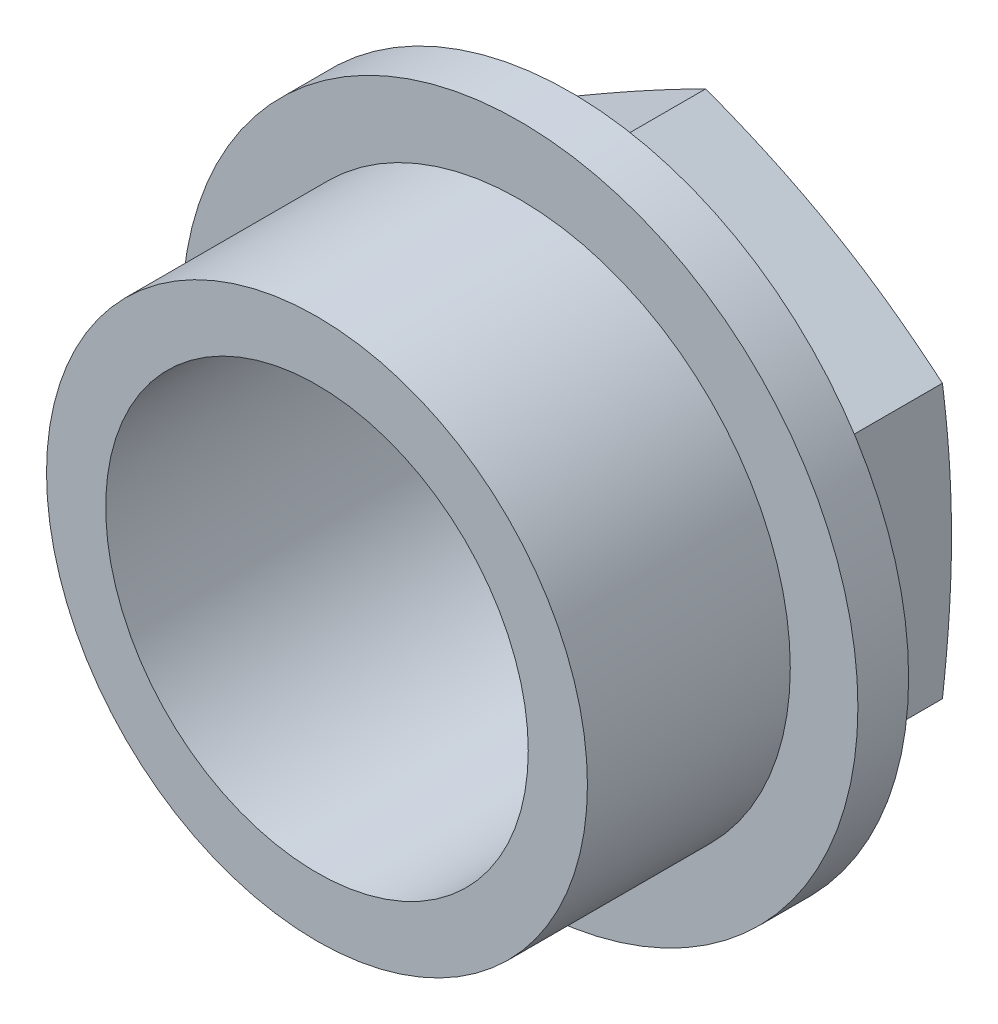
ISO-10303-21;
HEADER;
FILE_DESCRIPTION(('STEP AP214'),'2;1');
FILE_NAME('part.step','',(''),(''),'','','');
FILE_SCHEMA(('AUTOMOTIVE_DESIGN { 1 0 10303 214 1 1 1 1 }'));
ENDSEC;
DATA;
#1=APPLICATION_CONTEXT('core data for automotive mechanical design processes');
#2=APPLICATION_PROTOCOL_DEFINITION('international standard','automotive_design',2000,#1);
#3=PRODUCT_CONTEXT('',#1,'mechanical');
#4=PRODUCT('Part','Part','',(#3));
#5=PRODUCT_RELATED_PRODUCT_CATEGORY('part','',(#4));
#6=PRODUCT_DEFINITION_FORMATION('','',#4);
#7=PRODUCT_DEFINITION_CONTEXT('part definition',#1,'design');
#8=PRODUCT_DEFINITION('design','',#6,#7);
#9=PRODUCT_DEFINITION_SHAPE('','',#8);
#10=(LENGTH_UNIT() NAMED_UNIT(*) SI_UNIT(.MILLI.,.METRE.));
#11=(NAMED_UNIT(*) PLANE_ANGLE_UNIT() SI_UNIT($,.RADIAN.));
#12=(NAMED_UNIT(*) SI_UNIT($,.STERADIAN.) SOLID_ANGLE_UNIT());
#13=UNCERTAINTY_MEASURE_WITH_UNIT(LENGTH_MEASURE(1.E-05),#10,'distance_accuracy_value','');
#14=(GEOMETRIC_REPRESENTATION_CONTEXT(3) GLOBAL_UNCERTAINTY_ASSIGNED_CONTEXT((#13)) GLOBAL_UNIT_ASSIGNED_CONTEXT((#10,
#11,#12)) REPRESENTATION_CONTEXT('',''));
#15=CARTESIAN_POINT('',(0.,0.,0.));
#16=DIRECTION('',(0.,0.,1.));
#17=DIRECTION('',(1.,0.,0.));
#18=AXIS2_PLACEMENT_3D('',#15,#16,#17);
#19=CARTESIAN_POINT('',(-7.,4.04145188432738,-6.));
#20=DIRECTION('',(0.5,-0.866025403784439,0.));
#21=DIRECTION('',(0.866025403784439,0.5,0.));
#22=AXIS2_PLACEMENT_3D('',#19,#20,#21);
#23=PLANE('',#22);
#24=CARTESIAN_POINT('',(-7.0002,4.04133641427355,-3.99997139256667));
#25=CARTESIAN_POINT('',(-6.70935090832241,4.20925821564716,-4.04159057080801));
#26=CARTESIAN_POINT('',(-6.41804989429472,4.37744093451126,-4.07936064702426));
#27=CARTESIAN_POINT('',(-5.83456809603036,4.71431430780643,-4.14570329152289));
#28=CARTESIAN_POINT('',(-5.54238704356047,4.88300511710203,-4.17427269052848));
#29=CARTESIAN_POINT('',(-4.95866165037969,5.22001912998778,-4.22058144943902));
#30=CARTESIAN_POINT('',(-4.66712019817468,5.38834066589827,-4.23836809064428));
#31=CARTESIAN_POINT('',(-4.08371912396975,5.72516743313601,-4.26221695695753));
#32=CARTESIAN_POINT('',(-3.79185956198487,5.89367262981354,-4.26828110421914));
#33=CARTESIAN_POINT('',(-3.20814043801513,6.2306830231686,-4.26828110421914));
#34=CARTESIAN_POINT('',(-2.91628087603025,6.39918821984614,-4.26221695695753));
#35=CARTESIAN_POINT('',(-2.33287980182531,6.73601498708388,-4.23836809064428));
#36=CARTESIAN_POINT('',(-2.04133834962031,6.90433652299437,-4.22058144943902));
#37=CARTESIAN_POINT('',(-1.45761295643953,7.24135053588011,-4.17427269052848));
#38=CARTESIAN_POINT('',(-1.16543190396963,7.41004134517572,-4.14570329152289));
#39=CARTESIAN_POINT('',(-0.581950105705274,7.74691471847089,-4.07936064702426));
#40=CARTESIAN_POINT('',(-0.290649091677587,7.91509743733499,-4.04159057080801));
#41=CARTESIAN_POINT('',(0.000200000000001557,8.0830192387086,-3.99997139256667));
#42=B_SPLINE_CURVE_WITH_KNOTS('',3,(#24,#25,#26,#27,#28,#29,#30,#31,#32,#33,#34,#35,#36,#37,#38,
#39,#40,#41),.UNSPECIFIED.,.F.,.F.,(4,2,2,2,2,2,2,2,4),(0.,1.01528270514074,2.03091476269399,
3.04206054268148,4.05304050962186,5.06402047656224,6.07516625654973,7.09079831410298,
8.10608101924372),.UNSPECIFIED.);
#43=CARTESIAN_POINT('',(-7.,4.04145188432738,-4.));
#44=VERTEX_POINT('',#43);
#45=CARTESIAN_POINT('',(0.,8.08290376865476,-4.));
#46=VERTEX_POINT('',#45);
#47=EDGE_CURVE('E170',#44,#46,#42,.T.);
#48=ORIENTED_EDGE('',*,*,#47,.F.);
#49=DIRECTION('',(0.,0.,1.));
#50=VECTOR('',#49,1.);
#51=CARTESIAN_POINT('',(-7.,4.04145188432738,-6.));
#52=LINE('',#51,#50);
#53=CARTESIAN_POINT('',(-7.,4.04145188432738,0.));
#54=VERTEX_POINT('',#53);
#55=EDGE_CURVE('E65',#44,#54,#52,.T.);
#56=ORIENTED_EDGE('',*,*,#55,.T.);
#57=DIRECTION('',(0.866025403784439,0.5,0.));
#58=VECTOR('',#57,1.);
#59=CARTESIAN_POINT('',(-7.,4.04145188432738,0.));
#60=LINE('',#59,#58);
#61=CARTESIAN_POINT('',(0.,8.08290376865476,0.));
#62=VERTEX_POINT('',#61);
#63=EDGE_CURVE('E211',#54,#62,#60,.T.);
#64=ORIENTED_EDGE('',*,*,#63,.T.);
#65=DIRECTION('',(0.,0.,1.));
#66=VECTOR('',#65,1.);
#67=CARTESIAN_POINT('',(0.,8.08290376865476,-6.));
#68=LINE('',#67,#66);
#69=EDGE_CURVE('E244',#46,#62,#68,.T.);
#70=ORIENTED_EDGE('',*,*,#69,.F.);
#71=EDGE_LOOP('',(#48,#56,#64,#70));
#72=FACE_BOUND('',#71,.T.);
#73=ADVANCED_FACE('F39',(#72),#23,.F.);
#74=CARTESIAN_POINT('',(0.,8.08290376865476,-6.));
#75=DIRECTION('',(-0.5,-0.866025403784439,0.));
#76=DIRECTION('',(0.866025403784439,-0.5,0.));
#77=AXIS2_PLACEMENT_3D('',#74,#75,#76);
#78=PLANE('',#77);
#79=CARTESIAN_POINT('',(-0.000199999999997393,8.0830192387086,-3.99997139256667));
#80=CARTESIAN_POINT('',(0.290649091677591,7.91509743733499,-4.04159057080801));
#81=CARTESIAN_POINT('',(0.581950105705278,7.74691471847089,-4.07936064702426));
#82=CARTESIAN_POINT('',(1.16543190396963,7.41004134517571,-4.14570329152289));
#83=CARTESIAN_POINT('',(1.45761295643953,7.24135053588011,-4.17427269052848));
#84=CARTESIAN_POINT('',(2.04133834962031,6.90433652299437,-4.22058144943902));
#85=CARTESIAN_POINT('',(2.33287980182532,6.73601498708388,-4.23836809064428));
#86=CARTESIAN_POINT('',(2.91628087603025,6.39918821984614,-4.26221695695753));
#87=CARTESIAN_POINT('',(3.20814043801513,6.2306830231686,-4.26828110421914));
#88=CARTESIAN_POINT('',(3.79185956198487,5.89367262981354,-4.26828110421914));
#89=CARTESIAN_POINT('',(4.08371912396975,5.72516743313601,-4.26221695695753));
#90=CARTESIAN_POINT('',(4.66712019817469,5.38834066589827,-4.23836809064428));
#91=CARTESIAN_POINT('',(4.95866165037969,5.22001912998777,-4.22058144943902));
#92=CARTESIAN_POINT('',(5.54238704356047,4.88300511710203,-4.17427269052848));
#93=CARTESIAN_POINT('',(5.83456809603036,4.71431430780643,-4.1457032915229));
#94=CARTESIAN_POINT('',(6.41804989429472,4.37744093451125,-4.07936064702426));
#95=CARTESIAN_POINT('',(6.70935090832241,4.20925821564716,-4.04159057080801));
#96=CARTESIAN_POINT('',(7.0002,4.04133641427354,-3.99997139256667));
#97=B_SPLINE_CURVE_WITH_KNOTS('',3,(#79,#80,#81,#82,#83,#84,#85,#86,#87,#88,#89,#90,#91,#92,#93,
#94,#95,#96),.UNSPECIFIED.,.F.,.F.,(4,2,2,2,2,2,2,2,4),(0.,1.01528270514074,2.03091476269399,
3.04206054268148,4.05304050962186,5.06402047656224,6.07516625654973,7.09079831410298,
8.10608101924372),.UNSPECIFIED.);
#98=CARTESIAN_POINT('',(7.,4.04145188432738,-4.));
#99=VERTEX_POINT('',#98);
#100=EDGE_CURVE('E163',#46,#99,#97,.T.);
#101=ORIENTED_EDGE('',*,*,#100,.F.);
#102=ORIENTED_EDGE('',*,*,#69,.T.);
#103=DIRECTION('',(0.866025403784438,-0.5,0.));
#104=VECTOR('',#103,1.);
#105=CARTESIAN_POINT('',(0.,8.08290376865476,0.));
#106=LINE('',#105,#104);
#107=CARTESIAN_POINT('',(7.,4.04145188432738,0.));
#108=VERTEX_POINT('',#107);
#109=EDGE_CURVE('E218',#62,#108,#106,.T.);
#110=ORIENTED_EDGE('',*,*,#109,.T.);
#111=DIRECTION('',(0.,0.,1.));
#112=VECTOR('',#111,1.);
#113=CARTESIAN_POINT('',(7.,4.04145188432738,-6.));
#114=LINE('',#113,#112);
#115=EDGE_CURVE('E241',#99,#108,#114,.T.);
#116=ORIENTED_EDGE('',*,*,#115,.F.);
#117=EDGE_LOOP('',(#101,#102,#110,#116));
#118=FACE_BOUND('',#117,.T.);
#119=ADVANCED_FACE('F177',(#118),#78,.F.);
#120=CARTESIAN_POINT('',(7.,4.04145188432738,-6.));
#121=DIRECTION('',(-1.,0.,0.));
#122=DIRECTION('',(0.,-1.,0.));
#123=AXIS2_PLACEMENT_3D('',#120,#121,#122);
#124=PLANE('',#123);
#125=CARTESIAN_POINT('',(7.,12.3683158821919,-2.48161314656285));
#126=CARTESIAN_POINT('',(7.,12.0703111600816,-2.54585615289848));
#127=CARTESIAN_POINT('',(7.,11.7721927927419,-2.60957712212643));
#128=CARTESIAN_POINT('',(7.,11.1756812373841,-2.73573887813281));
#129=CARTESIAN_POINT('',(7.,10.8772880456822,-2.79817964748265));
#130=CARTESIAN_POINT('',(7.,10.2801398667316,-2.9215529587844));
#131=CARTESIAN_POINT('',(7.,9.98138482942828,-2.98248525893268));
#132=CARTESIAN_POINT('',(7.,9.38350779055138,-3.10252121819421));
#133=CARTESIAN_POINT('',(7.,9.0843857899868,-3.16162488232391));
#134=CARTESIAN_POINT('',(7.,8.48323727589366,-3.27810092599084));
#135=CARTESIAN_POINT('',(7.,8.1812071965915,-3.33545494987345));
#136=CARTESIAN_POINT('',(7.,7.57663993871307,-3.44742447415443));
#137=CARTESIAN_POINT('',(7.,7.27410276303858,-3.50203999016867));
#138=CARTESIAN_POINT('',(7.,6.66841162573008,-3.60792693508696));
#139=CARTESIAN_POINT('',(7.,6.36525760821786,-3.65919804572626));
#140=CARTESIAN_POINT('',(7.,5.75828027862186,-3.75763724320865));
#141=CARTESIAN_POINT('',(7.,5.45445696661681,-3.80480533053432));
#142=CARTESIAN_POINT('',(7.,4.85323988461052,-3.89307530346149));
#143=CARTESIAN_POINT('',(7.,4.55586337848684,-3.93429397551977));
#144=CARTESIAN_POINT('',(7.,3.96035495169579,-4.01096620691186));
#145=CARTESIAN_POINT('',(7.,3.66222301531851,-4.04641964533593));
#146=CARTESIAN_POINT('',(7.,3.06527736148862,-4.11047181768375));
#147=CARTESIAN_POINT('',(7.,2.76646379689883,-4.13907196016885));
#148=CARTESIAN_POINT('',(7.,2.16819312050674,-4.18834145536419));
#149=CARTESIAN_POINT('',(7.,1.8687360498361,-4.20901130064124));
#150=CARTESIAN_POINT('',(7.,1.27048252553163,-4.2414264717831));
#151=CARTESIAN_POINT('',(7.,0.97168793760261,-4.25320569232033));
#152=CARTESIAN_POINT('',(7.,0.373873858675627,-4.26737382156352));
#153=CARTESIAN_POINT('',(7.,0.0748543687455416,-4.26976277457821));
#154=CARTESIAN_POINT('',(7.,-0.523123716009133,-4.26502193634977));
#155=CARTESIAN_POINT('',(7.,-0.822082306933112,-4.25789165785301));
#156=CARTESIAN_POINT('',(7.,-1.41963258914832,-4.23448852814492));
#157=CARTESIAN_POINT('',(7.,-1.71822428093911,-4.21821568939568));
#158=CARTESIAN_POINT('',(7.,-2.448787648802,-4.16811075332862));
#159=CARTESIAN_POINT('',(7.,-2.88044386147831,-4.12967502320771));
#160=CARTESIAN_POINT('',(7.,-3.74217423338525,-4.03839914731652));
#161=CARTESIAN_POINT('',(7.,-4.17224842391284,-3.98555928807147));
#162=CARTESIAN_POINT('',(7.,-5.0320773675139,-3.86854978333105));
#163=CARTESIAN_POINT('',(7.,-5.46182771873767,-3.80434828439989));
#164=CARTESIAN_POINT('',(7.,-6.31995391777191,-3.66746088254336));
#165=CARTESIAN_POINT('',(7.,-6.74832977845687,-3.5947750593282));
#166=CARTESIAN_POINT('',(7.,-7.61167995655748,-3.44166517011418));
#167=CARTESIAN_POINT('',(7.,-8.04663351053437,-3.36112493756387));
#168=CARTESIAN_POINT('',(7.,-8.91559348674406,-3.19509147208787));
#169=CARTESIAN_POINT('',(7.,-9.34959989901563,-3.10959818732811));
#170=CARTESIAN_POINT('',(7.,-10.2147430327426,-2.93529444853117));
#171=CARTESIAN_POINT('',(7.,-10.6458834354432,-2.84650217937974));
#172=CARTESIAN_POINT('',(7.,-11.5075314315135,-2.66602565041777));
#173=CARTESIAN_POINT('',(7.,-11.9380390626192,-2.57434157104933));
#174=CARTESIAN_POINT('',(7.,-12.3683158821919,-2.48161314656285));
#175=B_SPLINE_CURVE_WITH_KNOTS('',3,(#125,#126,#127,#128,#129,#130,#131,#132,#133,#134,#135,
#136,#137,#138,#139,#140,#141,#142,#143,#144,#145,#146,#147,#148,#149,#150,#151,#152,#153,#154,
#155,#156,#157,#158,#159,#160,#161,#162,#163,#164,#165,#166,#167,#168,#169,#170,#171,#172,#173,
#174),.UNSPECIFIED.,.F.,.F.,(4,2,2,2,2,2,2,2,2,2,2,2,2,2,2,2,2,2,2,2,2,2,2,2,4),(0.,
0.914553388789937,1.82911922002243,2.74383071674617,3.65853970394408,4.58081186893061,
5.5030787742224,6.42543331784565,7.34778775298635,8.24839987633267,9.14903088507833,
10.049476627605,10.9498664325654,11.8468060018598,12.7437413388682,13.6407225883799,
14.5377026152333,15.8374712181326,17.1372139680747,18.4406601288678,19.7440940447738,
21.0710989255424,22.398117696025,23.7186730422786,25.0391461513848),.UNSPECIFIED.);
#176=CARTESIAN_POINT('',(7.,-4.04145188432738,-4.));
#177=VERTEX_POINT('',#176);
#178=EDGE_CURVE('E156',#99,#177,#175,.T.);
#179=ORIENTED_EDGE('',*,*,#178,.F.);
#180=ORIENTED_EDGE('',*,*,#115,.T.);
#181=DIRECTION('',(0.,-1.,0.));
#182=VECTOR('',#181,1.);
#183=CARTESIAN_POINT('',(7.,4.04145188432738,0.));
#184=LINE('',#183,#182);
#185=CARTESIAN_POINT('',(7.,-4.04145188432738,0.));
#186=VERTEX_POINT('',#185);
#187=EDGE_CURVE('E278',#108,#186,#184,.T.);
#188=ORIENTED_EDGE('',*,*,#187,.T.);
#189=DIRECTION('',(0.,0.,1.));
#190=VECTOR('',#189,1.);
#191=CARTESIAN_POINT('',(7.,-4.04145188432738,-6.));
#192=LINE('',#191,#190);
#193=EDGE_CURVE('E238',#177,#186,#192,.T.);
#194=ORIENTED_EDGE('',*,*,#193,.F.);
#195=EDGE_LOOP('',(#179,#180,#188,#194));
#196=FACE_BOUND('',#195,.T.);
#197=ADVANCED_FACE('F180',(#196),#124,.F.);
#198=CARTESIAN_POINT('',(7.,-4.04145188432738,-6.));
#199=DIRECTION('',(-0.5,0.866025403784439,0.));
#200=DIRECTION('',(-0.866025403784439,-0.5,0.));
#201=AXIS2_PLACEMENT_3D('',#198,#199,#200);
#202=PLANE('',#201);
#203=CARTESIAN_POINT('',(7.0002,-4.04133641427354,-3.99997139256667));
#204=CARTESIAN_POINT('',(6.70935090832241,-4.20925821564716,-4.04159057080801));
#205=CARTESIAN_POINT('',(6.41804989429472,-4.37744093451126,-4.07936064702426));
#206=CARTESIAN_POINT('',(5.83456809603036,-4.71431430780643,-4.14570329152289));
#207=CARTESIAN_POINT('',(5.54238704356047,-4.88300511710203,-4.17427269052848));
#208=CARTESIAN_POINT('',(4.95866165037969,-5.22001912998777,-4.22058144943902));
#209=CARTESIAN_POINT('',(4.66712019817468,-5.38834066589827,-4.23836809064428));
#210=CARTESIAN_POINT('',(4.08371912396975,-5.72516743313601,-4.26221695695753));
#211=CARTESIAN_POINT('',(3.79185956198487,-5.89367262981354,-4.26828110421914));
#212=CARTESIAN_POINT('',(3.20814043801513,-6.2306830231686,-4.26828110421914));
#213=CARTESIAN_POINT('',(2.91628087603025,-6.39918821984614,-4.26221695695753));
#214=CARTESIAN_POINT('',(2.33287980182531,-6.73601498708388,-4.23836809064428));
#215=CARTESIAN_POINT('',(2.04133834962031,-6.90433652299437,-4.22058144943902));
#216=CARTESIAN_POINT('',(1.45761295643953,-7.24135053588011,-4.17427269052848));
#217=CARTESIAN_POINT('',(1.16543190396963,-7.41004134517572,-4.14570329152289));
#218=CARTESIAN_POINT('',(0.581950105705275,-7.74691471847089,-4.07936064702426));
#219=CARTESIAN_POINT('',(0.290649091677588,-7.91509743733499,-4.04159057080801));
#220=CARTESIAN_POINT('',(-0.000200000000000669,-8.0830192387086,-3.99997139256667));
#221=B_SPLINE_CURVE_WITH_KNOTS('',3,(#203,#204,#205,#206,#207,#208,#209,#210,#211,#212,#213,
#214,#215,#216,#217,#218,#219,#220),.UNSPECIFIED.,.F.,.F.,(4,2,2,2,2,2,2,2,4),(0.,
1.01528270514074,2.03091476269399,3.04206054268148,4.05304050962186,5.06402047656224,
6.07516625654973,7.09079831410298,8.10608101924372),.UNSPECIFIED.);
#222=CARTESIAN_POINT('',(0.,-8.08290376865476,-4.));
#223=VERTEX_POINT('',#222);
#224=EDGE_CURVE('E149',#177,#223,#221,.T.);
#225=ORIENTED_EDGE('',*,*,#224,.F.);
#226=ORIENTED_EDGE('',*,*,#193,.T.);
#227=DIRECTION('',(-0.866025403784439,-0.5,0.));
#228=VECTOR('',#227,1.);
#229=CARTESIAN_POINT('',(7.,-4.04145188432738,0.));
#230=LINE('',#229,#228);
#231=CARTESIAN_POINT('',(0.,-8.08290376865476,0.));
#232=VERTEX_POINT('',#231);
#233=EDGE_CURVE('E229',#186,#232,#230,.T.);
#234=ORIENTED_EDGE('',*,*,#233,.T.);
#235=DIRECTION('',(0.,0.,1.));
#236=VECTOR('',#235,1.);
#237=CARTESIAN_POINT('',(0.,-8.08290376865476,-6.));
#238=LINE('',#237,#236);
#239=EDGE_CURVE('E235',#223,#232,#238,.T.);
#240=ORIENTED_EDGE('',*,*,#239,.F.);
#241=EDGE_LOOP('',(#225,#226,#234,#240));
#242=FACE_BOUND('',#241,.T.);
#243=ADVANCED_FACE('F274',(#242),#202,.F.);
#244=CARTESIAN_POINT('',(0.,-8.08290376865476,-6.));
#245=DIRECTION('',(0.5,0.866025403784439,0.));
#246=DIRECTION('',(-0.866025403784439,0.5,0.));
#247=AXIS2_PLACEMENT_3D('',#244,#245,#246);
#248=PLANE('',#247);
#249=CARTESIAN_POINT('',(0.00019999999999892,-8.0830192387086,-3.99997139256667));
#250=CARTESIAN_POINT('',(-0.29064909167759,-7.91509743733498,-4.04159057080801));
#251=CARTESIAN_POINT('',(-0.581950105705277,-7.74691471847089,-4.07936064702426));
#252=CARTESIAN_POINT('',(-1.16543190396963,-7.41004134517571,-4.1457032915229));
#253=CARTESIAN_POINT('',(-1.45761295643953,-7.24135053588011,-4.17427269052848));
#254=CARTESIAN_POINT('',(-2.04133834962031,-6.90433652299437,-4.22058144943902));
#255=CARTESIAN_POINT('',(-2.33287980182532,-6.73601498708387,-4.23836809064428));
#256=CARTESIAN_POINT('',(-2.91628087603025,-6.39918821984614,-4.26221695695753));
#257=CARTESIAN_POINT('',(-3.20814043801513,-6.2306830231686,-4.26828110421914));
#258=CARTESIAN_POINT('',(-3.79185956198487,-5.89367262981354,-4.26828110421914));
#259=CARTESIAN_POINT('',(-4.08371912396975,-5.725167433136,-4.26221695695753));
#260=CARTESIAN_POINT('',(-4.66712019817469,-5.38834066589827,-4.23836809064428));
#261=CARTESIAN_POINT('',(-4.95866165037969,-5.22001912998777,-4.22058144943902));
#262=CARTESIAN_POINT('',(-5.54238704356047,-4.88300511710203,-4.17427269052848));
#263=CARTESIAN_POINT('',(-5.83456809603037,-4.71431430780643,-4.14570329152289));
#264=CARTESIAN_POINT('',(-6.41804989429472,-4.37744093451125,-4.07936064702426));
#265=CARTESIAN_POINT('',(-6.70935090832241,-4.20925821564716,-4.04159057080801));
#266=CARTESIAN_POINT('',(-7.0002,-4.04133641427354,-3.99997139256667));
#267=B_SPLINE_CURVE_WITH_KNOTS('',3,(#249,#250,#251,#252,#253,#254,#255,#256,#257,#258,#259,
#260,#261,#262,#263,#264,#265,#266),.UNSPECIFIED.,.F.,.F.,(4,2,2,2,2,2,2,2,4),(0.,
1.01528270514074,2.03091476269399,3.04206054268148,4.05304050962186,5.06402047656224,
6.07516625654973,7.09079831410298,8.10608101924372),.UNSPECIFIED.);
#268=CARTESIAN_POINT('',(-7.,-4.04145188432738,-4.));
#269=VERTEX_POINT('',#268);
#270=EDGE_CURVE('E57',#223,#269,#267,.T.);
#271=ORIENTED_EDGE('',*,*,#270,.F.);
#272=ORIENTED_EDGE('',*,*,#239,.T.);
#273=DIRECTION('',(-0.866025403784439,0.5,0.));
#274=VECTOR('',#273,1.);
#275=CARTESIAN_POINT('',(0.,-8.08290376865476,0.));
#276=LINE('',#275,#274);
#277=CARTESIAN_POINT('',(-7.,-4.04145188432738,0.));
#278=VERTEX_POINT('',#277);
#279=EDGE_CURVE('E224',#232,#278,#276,.T.);
#280=ORIENTED_EDGE('',*,*,#279,.T.);
#281=DIRECTION('',(0.,0.,1.));
#282=VECTOR('',#281,1.);
#283=CARTESIAN_POINT('',(-7.,-4.04145188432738,-6.));
#284=LINE('',#283,#282);
#285=EDGE_CURVE('E222',#269,#278,#284,.T.);
#286=ORIENTED_EDGE('',*,*,#285,.F.);
#287=EDGE_LOOP('',(#271,#272,#280,#286));
#288=FACE_BOUND('',#287,.T.);
#289=ADVANCED_FACE('F204',(#288),#248,.F.);
#290=CARTESIAN_POINT('',(-7.,-4.04145188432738,-6.));
#291=DIRECTION('',(1.,0.,0.));
#292=DIRECTION('',(0.,1.,0.));
#293=AXIS2_PLACEMENT_3D('',#290,#291,#292);
#294=PLANE('',#293);
#295=CARTESIAN_POINT('',(-7.,-12.3683158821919,-2.48161314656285));
#296=CARTESIAN_POINT('',(-7.,-12.0703111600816,-2.54585615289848));
#297=CARTESIAN_POINT('',(-7.,-11.7721927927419,-2.60957712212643));
#298=CARTESIAN_POINT('',(-7.,-11.1756812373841,-2.73573887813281));
#299=CARTESIAN_POINT('',(-7.,-10.8772880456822,-2.79817964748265));
#300=CARTESIAN_POINT('',(-7.,-10.2801398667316,-2.9215529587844));
#301=CARTESIAN_POINT('',(-7.,-9.98138482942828,-2.98248525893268));
#302=CARTESIAN_POINT('',(-7.,-9.38350779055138,-3.10252121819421));
#303=CARTESIAN_POINT('',(-7.,-9.0843857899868,-3.16162488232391));
#304=CARTESIAN_POINT('',(-7.,-8.48323727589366,-3.27810092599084));
#305=CARTESIAN_POINT('',(-7.,-8.1812071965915,-3.33545494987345));
#306=CARTESIAN_POINT('',(-7.,-7.57663993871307,-3.44742447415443));
#307=CARTESIAN_POINT('',(-7.,-7.27410276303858,-3.50203999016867));
#308=CARTESIAN_POINT('',(-7.,-6.66841162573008,-3.60792693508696));
#309=CARTESIAN_POINT('',(-7.,-6.36525760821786,-3.65919804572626));
#310=CARTESIAN_POINT('',(-7.,-5.75828027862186,-3.75763724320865));
#311=CARTESIAN_POINT('',(-7.,-5.45445696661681,-3.80480533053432));
#312=CARTESIAN_POINT('',(-7.,-4.85323988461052,-3.89307530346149));
#313=CARTESIAN_POINT('',(-7.,-4.55586337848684,-3.93429397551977));
#314=CARTESIAN_POINT('',(-7.,-3.96035495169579,-4.01096620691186));
#315=CARTESIAN_POINT('',(-7.,-3.66222301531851,-4.04641964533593));
#316=CARTESIAN_POINT('',(-7.,-3.06527736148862,-4.11047181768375));
#317=CARTESIAN_POINT('',(-7.,-2.76646379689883,-4.13907196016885));
#318=CARTESIAN_POINT('',(-7.,-2.16819312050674,-4.18834145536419));
#319=CARTESIAN_POINT('',(-7.,-1.8687360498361,-4.20901130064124));
#320=CARTESIAN_POINT('',(-7.,-1.27048252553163,-4.2414264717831));
#321=CARTESIAN_POINT('',(-7.,-0.971687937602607,-4.25320569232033));
#322=CARTESIAN_POINT('',(-7.,-0.373873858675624,-4.26737382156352));
#323=CARTESIAN_POINT('',(-7.,-0.074854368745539,-4.26976277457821));
#324=CARTESIAN_POINT('',(-7.,0.523123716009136,-4.26502193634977));
#325=CARTESIAN_POINT('',(-7.,0.822082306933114,-4.25789165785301));
#326=CARTESIAN_POINT('',(-7.,1.41963258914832,-4.23448852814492));
#327=CARTESIAN_POINT('',(-7.,1.71822428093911,-4.21821568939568));
#328=CARTESIAN_POINT('',(-7.,2.448787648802,-4.16811075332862));
#329=CARTESIAN_POINT('',(-7.,2.88044386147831,-4.12967502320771));
#330=CARTESIAN_POINT('',(-7.,3.74217423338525,-4.03839914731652));
#331=CARTESIAN_POINT('',(-7.,4.17224842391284,-3.98555928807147));
#332=CARTESIAN_POINT('',(-7.,5.0320773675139,-3.86854978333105));
#333=CARTESIAN_POINT('',(-7.,5.46182771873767,-3.80434828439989));
#334=CARTESIAN_POINT('',(-7.,6.31995391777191,-3.66746088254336));
#335=CARTESIAN_POINT('',(-7.,6.74832977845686,-3.5947750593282));
#336=CARTESIAN_POINT('',(-7.,7.61167995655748,-3.44166517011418));
#337=CARTESIAN_POINT('',(-7.,8.04663351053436,-3.36112493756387));
#338=CARTESIAN_POINT('',(-7.,8.91559348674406,-3.19509147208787));
#339=CARTESIAN_POINT('',(-7.,9.34959989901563,-3.10959818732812));
#340=CARTESIAN_POINT('',(-7.,10.2147430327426,-2.93529444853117));
#341=CARTESIAN_POINT('',(-6.99999999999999,10.6458834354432,-2.84650217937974));
#342=CARTESIAN_POINT('',(-6.99999999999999,11.5075314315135,-2.66602565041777));
#343=CARTESIAN_POINT('',(-6.99999999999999,11.9380390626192,-2.57434157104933));
#344=CARTESIAN_POINT('',(-6.99999999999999,12.3683158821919,-2.48161314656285));
#345=B_SPLINE_CURVE_WITH_KNOTS('',3,(#295,#296,#297,#298,#299,#300,#301,#302,#303,#304,#305,
#306,#307,#308,#309,#310,#311,#312,#313,#314,#315,#316,#317,#318,#319,#320,#321,#322,#323,#324,
#325,#326,#327,#328,#329,#330,#331,#332,#333,#334,#335,#336,#337,#338,#339,#340,#341,#342,#343,
#344),.UNSPECIFIED.,.F.,.F.,(4,2,2,2,2,2,2,2,2,2,2,2,2,2,2,2,2,2,2,2,2,2,2,2,4),(0.,
0.914553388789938,1.82911922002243,2.74383071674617,3.65853970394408,4.5808118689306,
5.5030787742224,6.42543331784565,7.34778775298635,8.24839987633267,9.14903088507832,
10.049476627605,10.9498664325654,11.8468060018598,12.7437413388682,13.6407225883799,
14.5377026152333,15.8374712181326,17.1372139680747,18.4406601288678,19.7440940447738,
21.0710989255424,22.398117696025,23.7186730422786,25.0391461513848),.UNSPECIFIED.);
#346=EDGE_CURVE('E115',#269,#44,#345,.T.);
#347=ORIENTED_EDGE('',*,*,#346,.F.);
#348=ORIENTED_EDGE('',*,*,#285,.T.);
#349=DIRECTION('',(0.,1.,0.));
#350=VECTOR('',#349,1.);
#351=CARTESIAN_POINT('',(-7.,-4.04145188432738,0.));
#352=LINE('',#351,#350);
#353=EDGE_CURVE('E214',#278,#54,#352,.T.);
#354=ORIENTED_EDGE('',*,*,#353,.T.);
#355=ORIENTED_EDGE('',*,*,#55,.F.);
#356=EDGE_LOOP('',(#347,#348,#354,#355));
#357=FACE_BOUND('',#356,.T.);
#358=ADVANCED_FACE('F134',(#357),#294,.F.);
#359=CARTESIAN_POINT('',(0.,0.,0.));
#360=DIRECTION('',(0.,0.,1.));
#361=DIRECTION('',(1.,0.,0.));
#362=AXIS2_PLACEMENT_3D('',#359,#360,#361);
#363=PLANE('',#362);
#364=CARTESIAN_POINT('',(0.,0.,0.));
#365=DIRECTION('',(0.,0.,1.));
#366=DIRECTION('',(1.,0.,0.));
#367=AXIS2_PLACEMENT_3D('',#364,#365,#366);
#368=CIRCLE('',#367,10.);
#369=CARTESIAN_POINT('',(10.,0.,0.));
#370=VERTEX_POINT('',#369);
#371=EDGE_CURVE('E43',#370,#370,#368,.T.);
#372=ORIENTED_EDGE('',*,*,#371,.F.);
#373=EDGE_LOOP('',(#372));
#374=FACE_BOUND('',#373,.T.);
#375=ORIENTED_EDGE('',*,*,#63,.F.);
#376=ORIENTED_EDGE('',*,*,#353,.F.);
#377=ORIENTED_EDGE('',*,*,#279,.F.);
#378=ORIENTED_EDGE('',*,*,#233,.F.);
#379=ORIENTED_EDGE('',*,*,#187,.F.);
#380=ORIENTED_EDGE('',*,*,#109,.F.);
#381=EDGE_LOOP('',(#375,#376,#377,#378,#379,#380));
#382=FACE_BOUND('',#381,.T.);
#383=ADVANCED_FACE('F196',(#374,#382),#363,.F.);
#384=CARTESIAN_POINT('',(0.,0.,1.5));
#385=DIRECTION('',(0.,0.,-1.));
#386=DIRECTION('',(-1.,0.,0.));
#387=AXIS2_PLACEMENT_3D('',#384,#385,#386);
#388=CYLINDRICAL_SURFACE('',#387,10.);
#389=CARTESIAN_POINT('',(0.,0.,1.5));
#390=DIRECTION('',(0.,0.,1.));
#391=DIRECTION('',(1.,0.,0.));
#392=AXIS2_PLACEMENT_3D('',#389,#390,#391);
#393=CIRCLE('',#392,10.);
#394=CARTESIAN_POINT('',(10.,0.,1.5));
#395=VERTEX_POINT('',#394);
#396=EDGE_CURVE('E49',#395,#395,#393,.T.);
#397=ORIENTED_EDGE('',*,*,#396,.F.);
#398=EDGE_LOOP('',(#397));
#399=FACE_BOUND('',#398,.T.);
#400=ORIENTED_EDGE('',*,*,#371,.T.);
#401=EDGE_LOOP('',(#400));
#402=FACE_BOUND('',#401,.T.);
#403=ADVANCED_FACE('F41',(#399,#402),#388,.T.);
#404=CARTESIAN_POINT('',(0.,0.,1.5));
#405=DIRECTION('',(0.,0.,1.));
#406=DIRECTION('',(1.,0.,0.));
#407=AXIS2_PLACEMENT_3D('',#404,#405,#406);
#408=PLANE('',#407);
#409=CARTESIAN_POINT('',(0.,0.,1.5));
#410=DIRECTION('',(0.,0.,1.));
#411=DIRECTION('',(1.,0.,0.));
#412=AXIS2_PLACEMENT_3D('',#409,#410,#411);
#413=CIRCLE('',#412,8.);
#414=CARTESIAN_POINT('',(8.,0.,1.5));
#415=VERTEX_POINT('',#414);
#416=EDGE_CURVE('E11',#415,#415,#413,.T.);
#417=ORIENTED_EDGE('',*,*,#416,.F.);
#418=EDGE_LOOP('',(#417));
#419=FACE_BOUND('',#418,.T.);
#420=ORIENTED_EDGE('',*,*,#396,.T.);
#421=EDGE_LOOP('',(#420));
#422=FACE_BOUND('',#421,.T.);
#423=ADVANCED_FACE('F192',(#419,#422),#408,.T.);
#424=CARTESIAN_POINT('',(0.,0.,7.5));
#425=DIRECTION('',(0.,0.,-1.));
#426=DIRECTION('',(-1.,0.,0.));
#427=AXIS2_PLACEMENT_3D('',#424,#425,#426);
#428=CYLINDRICAL_SURFACE('',#427,8.);
#429=CARTESIAN_POINT('',(0.,0.,7.5));
#430=DIRECTION('',(0.,0.,1.));
#431=DIRECTION('',(1.,0.,0.));
#432=AXIS2_PLACEMENT_3D('',#429,#430,#431);
#433=CIRCLE('',#432,8.);
#434=CARTESIAN_POINT('',(8.,0.,7.5));
#435=VERTEX_POINT('',#434);
#436=EDGE_CURVE('E247',#435,#435,#433,.T.);
#437=ORIENTED_EDGE('',*,*,#436,.F.);
#438=EDGE_LOOP('',(#437));
#439=FACE_BOUND('',#438,.T.);
#440=ORIENTED_EDGE('',*,*,#416,.T.);
#441=EDGE_LOOP('',(#440));
#442=FACE_BOUND('',#441,.T.);
#443=ADVANCED_FACE('F188',(#439,#442),#428,.T.);
#444=CARTESIAN_POINT('',(0.,0.,7.5));
#445=DIRECTION('',(0.,0.,1.));
#446=DIRECTION('',(1.,0.,0.));
#447=AXIS2_PLACEMENT_3D('',#444,#445,#446);
#448=PLANE('',#447);
#449=CARTESIAN_POINT('',(0.,0.,7.5));
#450=DIRECTION('',(0.,0.,1.));
#451=DIRECTION('',(1.,0.,0.));
#452=AXIS2_PLACEMENT_3D('',#449,#450,#451);
#453=CIRCLE('',#452,6.25);
#454=CARTESIAN_POINT('',(6.25,0.,7.5));
#455=VERTEX_POINT('',#454);
#456=EDGE_CURVE('E110',#455,#455,#453,.T.);
#457=ORIENTED_EDGE('',*,*,#456,.F.);
#458=EDGE_LOOP('',(#457));
#459=FACE_BOUND('',#458,.T.);
#460=ORIENTED_EDGE('',*,*,#436,.T.);
#461=EDGE_LOOP('',(#460));
#462=FACE_BOUND('',#461,.T.);
#463=ADVANCED_FACE('F140',(#459,#462),#448,.T.);
#464=CARTESIAN_POINT('',(0.,0.,-6.));
#465=DIRECTION('',(0.,0.,1.));
#466=DIRECTION('',(0.,-1.,0.));
#467=AXIS2_PLACEMENT_3D('',#464,#465,#466);
#468=CONICAL_SURFACE('',#467,0.01,1.32794365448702);
#469=CARTESIAN_POINT('',(0.,0.,-6.));
#470=DIRECTION('',(0.,0.,-1.));
#471=DIRECTION('',(0.,1.,0.));
#472=AXIS2_PLACEMENT_3D('',#469,#470,#471);
#473=CIRCLE('',#472,0.01);
#474=CARTESIAN_POINT('',(0.,0.00999999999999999,-6.));
#475=VERTEX_POINT('',#474);
#476=EDGE_CURVE('E109',#475,#475,#473,.T.);
#477=ORIENTED_EDGE('',*,*,#476,.F.);
#478=EDGE_LOOP('',(#477));
#479=FACE_BOUND('',#478,.T.);
#480=ORIENTED_EDGE('',*,*,#47,.T.);
#481=ORIENTED_EDGE('',*,*,#100,.T.);
#482=ORIENTED_EDGE('',*,*,#178,.T.);
#483=ORIENTED_EDGE('',*,*,#224,.T.);
#484=ORIENTED_EDGE('',*,*,#270,.T.);
#485=ORIENTED_EDGE('',*,*,#346,.T.);
#486=EDGE_LOOP('',(#480,#481,#482,#483,#484,#485));
#487=FACE_BOUND('',#486,.T.);
#488=ADVANCED_FACE('F137',(#479,#487),#468,.T.);
#489=CARTESIAN_POINT('',(0.,0.,-6.));
#490=DIRECTION('',(0.,0.,-1.));
#491=DIRECTION('',(-1.,0.,0.));
#492=AXIS2_PLACEMENT_3D('',#489,#490,#491);
#493=PLANE('',#492);
#494=ORIENTED_EDGE('',*,*,#476,.T.);
#495=EDGE_LOOP('',(#494));
#496=FACE_BOUND('',#495,.T.);
#497=ADVANCED_FACE('F102',(#496),#493,.T.);
#498=CARTESIAN_POINT('',(0.,0.,-1.5));
#499=DIRECTION('',(0.,0.,1.));
#500=DIRECTION('',(1.,0.,0.));
#501=AXIS2_PLACEMENT_3D('',#498,#499,#500);
#502=CONICAL_SURFACE('',#501,6.25,1.02974425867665);
#503=CARTESIAN_POINT('',(0.,0.,-5.25537886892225));
#504=VERTEX_POINT('',#503);
#505=VERTEX_LOOP('',#504);
#506=FACE_BOUND('',#505,.T.);
#507=CARTESIAN_POINT('',(0.,0.,-1.5));
#508=DIRECTION('',(0.,0.,1.));
#509=DIRECTION('',(1.,0.,0.));
#510=AXIS2_PLACEMENT_3D('',#507,#508,#509);
#511=CIRCLE('',#510,6.25);
#512=CARTESIAN_POINT('',(6.25,0.,-1.5));
#513=VERTEX_POINT('',#512);
#514=EDGE_CURVE('E106',#513,#513,#511,.T.);
#515=ORIENTED_EDGE('',*,*,#514,.T.);
#516=EDGE_LOOP('',(#515));
#517=FACE_BOUND('',#516,.T.);
#518=ADVANCED_FACE('F98',(#506,#517),#502,.F.);
#519=CARTESIAN_POINT('',(0.,0.,7.5));
#520=DIRECTION('',(0.,0.,1.));
#521=DIRECTION('',(1.,0.,0.));
#522=AXIS2_PLACEMENT_3D('',#519,#520,#521);
#523=CYLINDRICAL_SURFACE('',#522,6.25);
#524=ORIENTED_EDGE('',*,*,#514,.F.);
#525=EDGE_LOOP('',(#524));
#526=FACE_BOUND('',#525,.T.);
#527=ORIENTED_EDGE('',*,*,#456,.T.);
#528=EDGE_LOOP('',(#527));
#529=FACE_BOUND('',#528,.T.);
#530=ADVANCED_FACE('F101',(#526,#529),#523,.F.);
#531=CLOSED_SHELL('',(#73,#119,#197,#243,#289,#358,#383,#403,#423,#443,#463,#488,#497,#518,#530));
#532=MANIFOLD_SOLID_BREP('B2',#531);
#533=ADVANCED_BREP_SHAPE_REPRESENTATION('',(#18,#532),#14);
#534=SHAPE_DEFINITION_REPRESENTATION(#9,#533);
ENDSEC;
END-ISO-10303-21;
